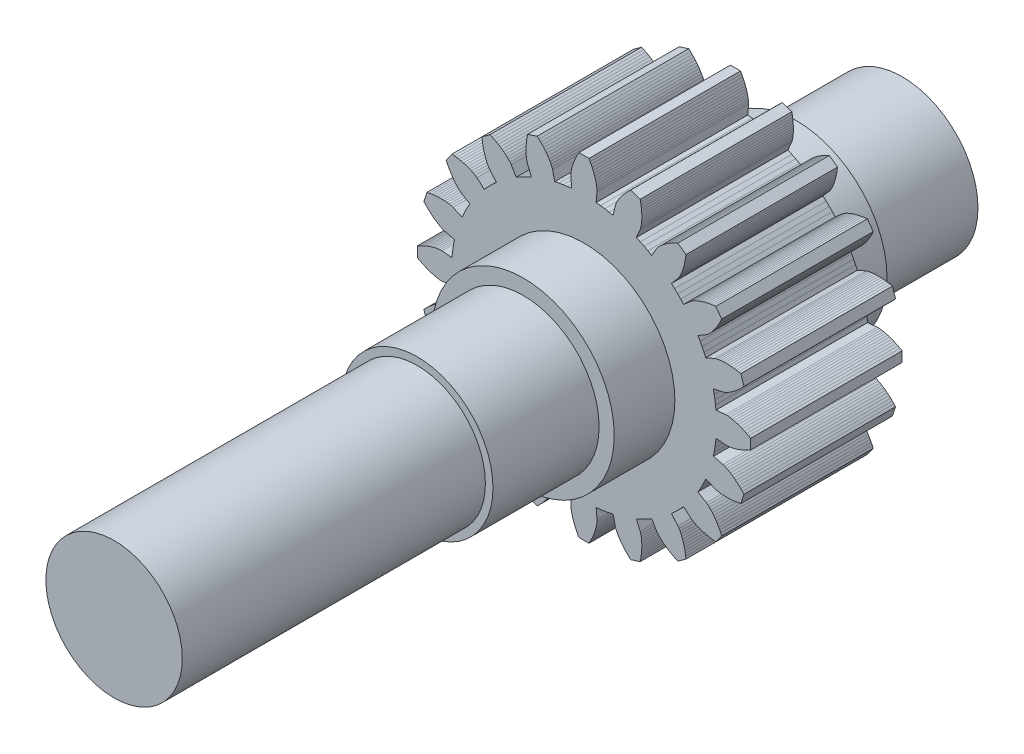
from build123d import *

# Parameters (mm, degrees)
AUFSATZ_LINEAR_AUSTRAGEN1_DEPTH = 10
SKIZZE2_R                       = 12
AUFSATZ_LINEAR_AUSTRAGEN2_DEPTH = 18
SKIZZE3_R                       = 10
AUFSATZ_LINEAR_AUSTRAGEN3_DEPTH = 32
SKIZZE4_R                       = 9
AUFSATZ_LINEAR_AUSTRAGEN4_DEPTH = 72


with BuildPart() as part:
    # Skizze1 → Aufsatz-Linear austragen1 (new, symmetric)
    with BuildSketch(Plane.XY):
        Polygon((17.425679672, -1.611113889), (18.714037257, -1.730230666), (18.982844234, -1.724686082), (19.253876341, -1.693505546), (19.526223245, -1.644958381), (19.799478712, -1.581853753), (20.073351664, -1.505747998), (20.347601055, -1.417649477), (20.622012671, -1.318270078), (20.89638846, -1.208141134), (21.170540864, -1.08767527), (21.444289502, -0.957202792), (21.717459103, -0.816994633), (21.989878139, -0.667277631), (21.989878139, 0.667277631), (21.717459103, 0.816994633), (21.444289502, 0.957202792), (21.170540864, 1.08767527), (20.89638846, 1.208141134), (20.622012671, 1.318270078), (20.347601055, 1.417649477), (20.073351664, 1.505747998), (19.799478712, 1.581853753), (19.526223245, 1.644958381), (19.253876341, 1.693505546), (18.982844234, 1.724686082), (18.714037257, 1.730230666), (17.425679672, 1.611113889), (17.364250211, 2.175503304), (17.28454596, 2.737603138), (17.186650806, 3.296821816), (17.070667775, 3.852570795), (18.33277776, 4.137408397), (18.586715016, 4.225747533), (18.834846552, 4.339155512), (19.07886195, 4.469486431), (19.319242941, 4.613943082), (19.556193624, 4.770955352), (19.789796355, 4.939489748), (20.020067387, 5.118803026), (20.246982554, 5.308328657), (20.470490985, 5.507616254), (20.690523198, 5.716295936), (20.906996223, 5.934055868), (21.119817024, 6.16062731), (20.707416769, 7.429864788), (20.402065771, 7.488072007), (20.098939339, 7.537003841), (19.798270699, 7.576497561), (19.50031027, 7.606349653), (19.205331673, 7.626301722), (18.913640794, 7.636019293), (18.625590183, 7.635058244), (18.341603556, 7.622807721), (18.062221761, 7.598383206), (17.788202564, 7.560394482), (17.520800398, 7.506295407), (17.2634364, 7.428502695), (16.074944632, 6.917091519), (15.842115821, 7.434875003), (15.592614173, 7.944833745), (15.326702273, 8.446431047), (15.044659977, 8.939139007), (16.156978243, 9.600049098), (16.371188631, 9.762535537), (16.572130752, 9.947069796), (16.763928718, 10.146426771), (16.947905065, 10.358095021), (17.124739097, 10.580644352), (17.294828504, 10.813117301), (17.45841842, 11.054812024), (17.615660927, 11.305182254), (17.766646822, 11.563783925), (17.911424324, 11.83024379), (18.050010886, 12.104239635), (18.182401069, 12.385487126), (17.397969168, 13.465165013), (17.089576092, 13.426164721), (16.786164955, 13.379030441), (16.488007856, 13.323679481), (16.195405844, 13.259995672), (15.908698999, 13.187817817), (15.628281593, 13.106922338), (15.354626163, 13.016995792), (15.088324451, 12.917588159), (14.830164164, 12.808025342), (14.581295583, 12.68721933), (14.343698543, 12.553136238), (14.122970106, 12.399621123), (13.15068201, 11.545976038), (12.769244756, 11.966469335), (12.374368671, 12.374368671), (11.966469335, 12.769244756), (11.545976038, 13.15068201), (12.399621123, 14.122970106), (12.553136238, 14.343698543), (12.68721933, 14.581295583), (12.808025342, 14.830164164), (12.917588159, 15.088324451), (13.016995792, 15.354626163), (13.106922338, 15.628281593), (13.187817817, 15.908698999), (13.259995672, 16.195405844), (13.323679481, 16.488007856), (13.379030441, 16.786164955), (13.426164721, 17.089576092), (13.465165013, 17.397969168), (12.385487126, 18.182401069), (12.104239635, 18.050010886), (11.83024379, 17.911424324), (11.563783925, 17.766646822), (11.305182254, 17.615660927), (11.054812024, 17.45841842), (10.813117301, 17.294828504), (10.580644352, 17.124739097), (10.358095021, 16.947905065), (10.146426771, 16.763928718), (9.947069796, 16.572130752), (9.762535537, 16.371188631), (9.600049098, 16.156978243), (8.939139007, 15.044659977), (8.446431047, 15.326702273), (7.944833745, 15.592614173), (7.434875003, 15.842115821), (6.917091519, 16.074944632), (7.428502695, 17.2634364), (7.506295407, 17.520800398), (7.560394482, 17.788202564), (7.598383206, 18.062221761), (7.622807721, 18.341603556), (7.635058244, 18.625590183), (7.636019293, 18.913640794), (7.626301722, 19.205331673), (7.606349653, 19.50031027), (7.576497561, 19.798270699), (7.537003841, 20.098939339), (7.488072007, 20.402065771), (7.429864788, 20.707416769), (6.16062731, 21.119817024), (5.934055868, 20.906996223), (5.716295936, 20.690523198), (5.507616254, 20.470490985), (5.308328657, 20.246982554), (5.118803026, 20.020067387), (4.939489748, 19.789796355), (4.770955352, 19.556193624), (4.613943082, 19.319242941), (4.469486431, 19.07886195), (4.339155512, 18.834846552), (4.225747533, 18.586715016), (4.137408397, 18.33277776), (3.852570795, 17.070667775), (3.296821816, 17.186650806), (2.737603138, 17.28454596), (2.175503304, 17.364250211), (1.611113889, 17.425679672), (1.730230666, 18.714037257), (1.724686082, 18.982844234), (1.693505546, 19.253876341), (1.644958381, 19.526223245), (1.581853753, 19.799478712), (1.505747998, 20.073351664), (1.417649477, 20.347601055), (1.318270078, 20.622012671), (1.208141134, 20.89638846), (1.08767527, 21.170540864), (0.957202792, 21.444289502), (0.816994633, 21.717459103), (0.667277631, 21.989878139), (-0.667277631, 21.989878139), (-0.816994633, 21.717459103), (-0.957202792, 21.444289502), (-1.08767527, 21.170540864), (-1.208141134, 20.89638846), (-1.318270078, 20.622012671), (-1.417649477, 20.347601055), (-1.505747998, 20.073351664), (-1.581853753, 19.799478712), (-1.644958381, 19.526223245), (-1.693505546, 19.253876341), (-1.724686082, 18.982844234), (-1.730230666, 18.714037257), (-1.611113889, 17.425679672), (-2.175503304, 17.364250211), (-2.737603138, 17.28454596), (-3.296821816, 17.186650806), (-3.852570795, 17.070667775), (-4.137408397, 18.33277776), (-4.225747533, 18.586715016), (-4.339155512, 18.834846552), (-4.469486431, 19.07886195), (-4.613943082, 19.319242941), (-4.770955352, 19.556193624), (-4.939489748, 19.789796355), (-5.118803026, 20.020067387), (-5.308328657, 20.246982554), (-5.507616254, 20.470490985), (-5.716295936, 20.690523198), (-5.934055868, 20.906996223), (-6.16062731, 21.119817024), (-7.429864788, 20.707416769), (-7.488072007, 20.402065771), (-7.537003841, 20.098939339), (-7.576497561, 19.798270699), (-7.606349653, 19.50031027), (-7.626301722, 19.205331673), (-7.636019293, 18.913640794), (-7.635058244, 18.625590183), (-7.622807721, 18.341603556), (-7.598383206, 18.062221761), (-7.560394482, 17.788202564), (-7.506295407, 17.520800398), (-7.428502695, 17.2634364), (-6.917091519, 16.074944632), (-7.434875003, 15.842115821), (-7.944833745, 15.592614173), (-8.446431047, 15.326702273), (-8.939139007, 15.044659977), (-9.600049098, 16.156978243), (-9.762535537, 16.371188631), (-9.947069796, 16.572130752), (-10.146426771, 16.763928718), (-10.358095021, 16.947905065), (-10.580644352, 17.124739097), (-10.813117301, 17.294828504), (-11.054812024, 17.45841842), (-11.305182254, 17.615660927), (-11.563783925, 17.766646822), (-11.83024379, 17.911424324), (-12.104239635, 18.050010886), (-12.385487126, 18.182401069), (-13.465165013, 17.397969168), (-13.426164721, 17.089576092), (-13.379030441, 16.786164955), (-13.323679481, 16.488007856), (-13.259995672, 16.195405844), (-13.187817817, 15.908698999), (-13.106922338, 15.628281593), (-13.016995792, 15.354626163), (-12.917588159, 15.088324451), (-12.808025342, 14.830164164), (-12.68721933, 14.581295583), (-12.553136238, 14.343698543), (-12.399621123, 14.122970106), (-11.545976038, 13.15068201), (-11.966469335, 12.769244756), (-12.374368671, 12.374368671), (-12.769244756, 11.966469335), (-13.15068201, 11.545976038), (-14.122970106, 12.399621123), (-14.343698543, 12.553136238), (-14.581295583, 12.68721933), (-14.830164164, 12.808025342), (-15.088324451, 12.917588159), (-15.354626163, 13.016995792), (-15.628281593, 13.106922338), (-15.908698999, 13.187817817), (-16.195405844, 13.259995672), (-16.488007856, 13.323679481), (-16.786164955, 13.379030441), (-17.089576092, 13.426164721), (-17.397969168, 13.465165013), (-18.182401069, 12.385487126), (-18.050010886, 12.104239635), (-17.911424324, 11.83024379), (-17.766646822, 11.563783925), (-17.615660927, 11.305182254), (-17.45841842, 11.054812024), (-17.294828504, 10.813117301), (-17.124739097, 10.580644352), (-16.947905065, 10.358095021), (-16.763928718, 10.146426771), (-16.572130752, 9.947069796), (-16.371188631, 9.762535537), (-16.156978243, 9.600049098), (-15.044659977, 8.939139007), (-15.326702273, 8.446431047), (-15.592614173, 7.944833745), (-15.842115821, 7.434875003), (-16.074944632, 6.917091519), (-17.2634364, 7.428502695), (-17.520800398, 7.506295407), (-17.788202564, 7.560394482), (-18.062221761, 7.598383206), (-18.341603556, 7.622807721), (-18.625590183, 7.635058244), (-18.913640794, 7.636019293), (-19.205331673, 7.626301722), (-19.50031027, 7.606349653), (-19.798270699, 7.576497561), (-20.098939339, 7.537003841), (-20.402065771, 7.488072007), (-20.707416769, 7.429864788), (-21.119817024, 6.16062731), (-20.906996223, 5.934055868), (-20.690523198, 5.716295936), (-20.470490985, 5.507616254), (-20.246982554, 5.308328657), (-20.020067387, 5.118803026), (-19.789796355, 4.939489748), (-19.556193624, 4.770955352), (-19.319242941, 4.613943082), (-19.07886195, 4.469486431), (-18.834846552, 4.339155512), (-18.586715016, 4.225747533), (-18.33277776, 4.137408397), (-17.070667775, 3.852570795), (-17.186650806, 3.296821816), (-17.28454596, 2.737603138), (-17.364250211, 2.175503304), (-17.425679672, 1.611113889), (-18.714037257, 1.730230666), (-18.982844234, 1.724686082), (-19.253876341, 1.693505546), (-19.526223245, 1.644958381), (-19.799478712, 1.581853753), (-20.073351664, 1.505747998), (-20.347601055, 1.417649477), (-20.622012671, 1.318270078), (-20.89638846, 1.208141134), (-21.170540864, 1.08767527), (-21.444289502, 0.957202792), (-21.717459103, 0.816994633), (-21.989878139, 0.667277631), (-21.989878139, -0.667277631), (-21.717459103, -0.816994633), (-21.444289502, -0.957202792), (-21.170540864, -1.08767527), (-20.89638846, -1.208141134), (-20.622012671, -1.318270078), (-20.347601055, -1.417649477), (-20.073351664, -1.505747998), (-19.799478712, -1.581853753), (-19.526223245, -1.644958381), (-19.253876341, -1.693505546), (-18.982844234, -1.724686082), (-18.714037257, -1.730230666), (-17.425679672, -1.611113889), (-17.364250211, -2.175503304), (-17.28454596, -2.737603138), (-17.186650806, -3.296821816), (-17.070667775, -3.852570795), (-18.33277776, -4.137408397), (-18.586715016, -4.225747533), (-18.834846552, -4.339155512), (-19.07886195, -4.469486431), (-19.319242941, -4.613943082), (-19.556193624, -4.770955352), (-19.789796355, -4.939489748), (-20.020067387, -5.118803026), (-20.246982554, -5.308328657), (-20.470490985, -5.507616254), (-20.690523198, -5.716295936), (-20.906996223, -5.934055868), (-21.119817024, -6.16062731), (-20.707416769, -7.429864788), (-20.402065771, -7.488072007), (-20.098939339, -7.537003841), (-19.798270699, -7.576497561), (-19.50031027, -7.606349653), (-19.205331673, -7.626301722), (-18.913640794, -7.636019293), (-18.625590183, -7.635058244), (-18.341603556, -7.622807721), (-18.062221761, -7.598383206), (-17.788202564, -7.560394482), (-17.520800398, -7.506295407), (-17.2634364, -7.428502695), (-16.074944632, -6.917091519), (-15.842115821, -7.434875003), (-15.592614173, -7.944833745), (-15.326702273, -8.446431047), (-15.044659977, -8.939139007), (-16.156978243, -9.600049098), (-16.371188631, -9.762535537), (-16.572130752, -9.947069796), (-16.763928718, -10.146426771), (-16.947905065, -10.358095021), (-17.124739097, -10.580644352), (-17.294828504, -10.813117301), (-17.45841842, -11.054812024), (-17.615660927, -11.305182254), (-17.766646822, -11.563783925), (-17.911424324, -11.83024379), (-18.050010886, -12.104239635), (-18.182401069, -12.385487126), (-17.397969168, -13.465165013), (-17.089576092, -13.426164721), (-16.786164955, -13.379030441), (-16.488007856, -13.323679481), (-16.195405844, -13.259995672), (-15.908698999, -13.187817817), (-15.628281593, -13.106922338), (-15.354626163, -13.016995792), (-15.088324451, -12.917588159), (-14.830164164, -12.808025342), (-14.581295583, -12.68721933), (-14.343698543, -12.553136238), (-14.122970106, -12.399621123), (-13.15068201, -11.545976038), (-12.769244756, -11.966469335), (-12.374368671, -12.374368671), (-11.966469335, -12.769244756), (-11.545976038, -13.15068201), (-12.399621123, -14.122970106), (-12.553136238, -14.343698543), (-12.68721933, -14.581295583), (-12.808025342, -14.830164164), (-12.917588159, -15.088324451), (-13.016995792, -15.354626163), (-13.106922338, -15.628281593), (-13.187817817, -15.908698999), (-13.259995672, -16.195405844), (-13.323679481, -16.488007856), (-13.379030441, -16.786164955), (-13.426164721, -17.089576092), (-13.465165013, -17.397969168), (-12.385487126, -18.182401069), (-12.104239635, -18.050010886), (-11.83024379, -17.911424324), (-11.563783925, -17.766646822), (-11.305182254, -17.615660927), (-11.054812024, -17.45841842), (-10.813117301, -17.294828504), (-10.580644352, -17.124739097), (-10.358095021, -16.947905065), (-10.146426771, -16.763928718), (-9.947069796, -16.572130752), (-9.762535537, -16.371188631), (-9.600049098, -16.156978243), (-8.939139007, -15.044659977), (-8.446431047, -15.326702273), (-7.944833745, -15.592614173), (-7.434875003, -15.842115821), (-6.917091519, -16.074944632), (-7.428502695, -17.2634364), (-7.506295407, -17.520800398), (-7.560394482, -17.788202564), (-7.598383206, -18.062221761), (-7.622807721, -18.341603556), (-7.635058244, -18.625590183), (-7.636019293, -18.913640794), (-7.626301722, -19.205331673), (-7.606349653, -19.50031027), (-7.576497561, -19.798270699), (-7.537003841, -20.098939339), (-7.488072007, -20.402065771), (-7.429864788, -20.707416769), (-6.16062731, -21.119817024), (-5.934055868, -20.906996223), (-5.716295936, -20.690523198), (-5.507616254, -20.470490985), (-5.308328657, -20.246982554), (-5.118803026, -20.020067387), (-4.939489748, -19.789796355), (-4.770955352, -19.556193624), (-4.613943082, -19.319242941), (-4.469486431, -19.07886195), (-4.339155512, -18.834846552), (-4.225747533, -18.586715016), (-4.137408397, -18.33277776), (-3.852570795, -17.070667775), (-3.296821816, -17.186650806), (-2.737603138, -17.28454596), (-2.175503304, -17.364250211), (-1.611113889, -17.425679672), (-1.730230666, -18.714037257), (-1.724686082, -18.982844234), (-1.693505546, -19.253876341), (-1.644958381, -19.526223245), (-1.581853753, -19.799478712), (-1.505747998, -20.073351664), (-1.417649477, -20.347601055), (-1.318270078, -20.622012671), (-1.208141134, -20.89638846), (-1.08767527, -21.170540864), (-0.957202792, -21.444289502), (-0.816994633, -21.717459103), (-0.667277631, -21.989878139), (0.667277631, -21.989878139), (0.816994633, -21.717459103), (0.957202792, -21.444289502), (1.08767527, -21.170540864), (1.208141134, -20.89638846), (1.318270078, -20.622012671), (1.417649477, -20.347601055), (1.505747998, -20.073351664), (1.581853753, -19.799478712), (1.644958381, -19.526223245), (1.693505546, -19.253876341), (1.724686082, -18.982844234), (1.730230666, -18.714037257), (1.611113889, -17.425679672), (2.175503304, -17.364250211), (2.737603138, -17.28454596), (3.296821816, -17.186650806), (3.852570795, -17.070667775), (4.137408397, -18.33277776), (4.225747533, -18.586715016), (4.339155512, -18.834846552), (4.469486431, -19.07886195), (4.613943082, -19.319242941), (4.770955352, -19.556193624), (4.939489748, -19.789796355), (5.118803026, -20.020067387), (5.308328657, -20.246982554), (5.507616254, -20.470490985), (5.716295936, -20.690523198), (5.934055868, -20.906996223), (6.16062731, -21.119817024), (7.429864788, -20.707416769), (7.488072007, -20.402065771), (7.537003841, -20.098939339), (7.576497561, -19.798270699), (7.606349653, -19.50031027), (7.626301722, -19.205331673), (7.636019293, -18.913640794), (7.635058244, -18.625590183), (7.622807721, -18.341603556), (7.598383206, -18.062221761), (7.560394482, -17.788202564), (7.506295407, -17.520800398), (7.428502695, -17.2634364), (6.917091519, -16.074944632), (7.434875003, -15.842115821), (7.944833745, -15.592614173), (8.446431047, -15.326702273), (8.939139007, -15.044659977), (9.600049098, -16.156978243), (9.762535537, -16.371188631), (9.947069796, -16.572130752), (10.146426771, -16.763928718), (10.358095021, -16.947905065), (10.580644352, -17.124739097), (10.813117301, -17.294828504), (11.054812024, -17.45841842), (11.305182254, -17.615660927), (11.563783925, -17.766646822), (11.83024379, -17.911424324), (12.104239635, -18.050010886), (12.385487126, -18.182401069), (13.465165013, -17.397969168), (13.426164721, -17.089576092), (13.379030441, -16.786164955), (13.323679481, -16.488007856), (13.259995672, -16.195405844), (13.187817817, -15.908698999), (13.106922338, -15.628281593), (13.016995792, -15.354626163), (12.917588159, -15.088324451), (12.808025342, -14.830164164), (12.68721933, -14.581295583), (12.553136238, -14.343698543), (12.399621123, -14.122970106), (11.545976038, -13.15068201), (11.966469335, -12.769244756), (12.374368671, -12.374368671), (12.769244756, -11.966469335), (13.15068201, -11.545976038), (14.122970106, -12.399621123), (14.343698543, -12.553136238), (14.581295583, -12.68721933), (14.830164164, -12.808025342), (15.088324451, -12.917588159), (15.354626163, -13.016995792), (15.628281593, -13.106922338), (15.908698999, -13.187817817), (16.195405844, -13.259995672), (16.488007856, -13.323679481), (16.786164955, -13.379030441), (17.089576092, -13.426164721), (17.397969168, -13.465165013), (18.182401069, -12.385487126), (18.050010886, -12.104239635), (17.911424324, -11.83024379), (17.766646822, -11.563783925), (17.615660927, -11.305182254), (17.45841842, -11.054812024), (17.294828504, -10.813117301), (17.124739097, -10.580644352), (16.947905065, -10.358095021), (16.763928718, -10.146426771), (16.572130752, -9.947069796), (16.371188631, -9.762535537), (16.156978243, -9.600049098), (15.044659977, -8.939139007), (15.326702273, -8.446431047), (15.592614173, -7.944833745), (15.842115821, -7.434875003), (16.074944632, -6.917091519), (17.2634364, -7.428502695), (17.520800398, -7.506295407), (17.788202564, -7.560394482), (18.062221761, -7.598383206), (18.341603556, -7.622807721), (18.625590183, -7.635058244), (18.913640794, -7.636019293), (19.205331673, -7.626301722), (19.50031027, -7.606349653), (19.798270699, -7.576497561), (20.098939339, -7.537003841), (20.402065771, -7.488072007), (20.707416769, -7.429864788), (21.119817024, -6.16062731), (20.906996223, -5.934055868), (20.690523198, -5.716295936), (20.470490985, -5.507616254), (20.246982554, -5.308328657), (20.020067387, -5.118803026), (19.789796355, -4.939489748), (19.556193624, -4.770955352), (19.319242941, -4.613943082), (19.07886195, -4.469486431), (18.834846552, -4.339155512), (18.586715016, -4.225747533), (18.33277776, -4.137408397), (17.070667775, -3.852570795), (17.186650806, -3.296821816), (17.28454596, -2.737603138), (17.364250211, -2.175503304), align=None)
    extrude(amount=AUFSATZ_LINEAR_AUSTRAGEN1_DEPTH, both=True)

    # Skizze2 → Aufsatz-Linear austragen2 (add, symmetric)
    with BuildSketch(Plane.XY):
        Circle(SKIZZE2_R)
    extrude(amount=AUFSATZ_LINEAR_AUSTRAGEN2_DEPTH, both=True)

    # Skizze3 → Aufsatz-Linear austragen3 (add, symmetric)
    with BuildSketch(Plane.XY):
        Circle(SKIZZE3_R)
    extrude(amount=AUFSATZ_LINEAR_AUSTRAGEN3_DEPTH, both=True)

    # Skizze4 → Aufsatz-Linear austragen4 (add)
    with BuildSketch(Plane.XY):
        Circle(SKIZZE4_R)
    extrude(amount=AUFSATZ_LINEAR_AUSTRAGEN4_DEPTH)


solid = part.part
